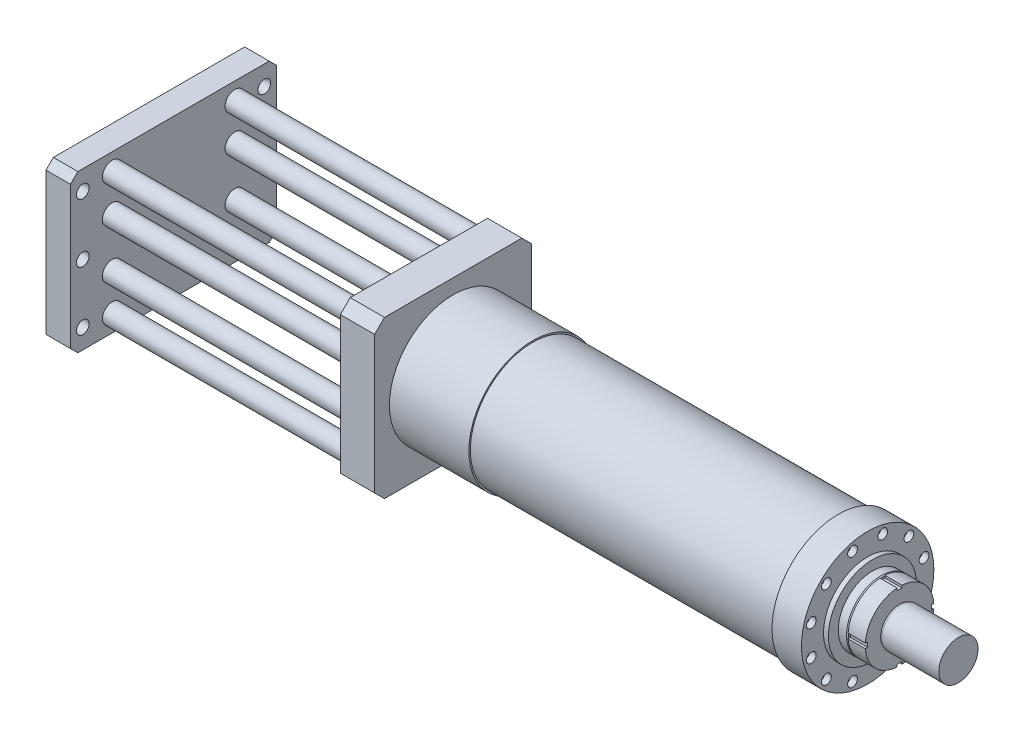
from build123d import *

# Parameters (mm, degrees)
SKETCH_1_R                = 127
SKETCH_1_R_2              = 110
EXTRUDE_1_DEPTH           = 623
SKETCH_2_R                = 135
SKETCH_2_R_2              = 6.5
EXTRUDE_2_DEPTH           = 60
SKETCH_3_R                = 90
EXTRUDE_3_DEPTH           = 10
SKETCH_5_R                = 70
EXTRUDE_4_DEPTH           = 20
CHAMFER_1_SIZE            = 3
CHAMFER_1_SIZE2           = 1.091910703
SKETCH_7_R                = 70
EXTRUDE_5_DEPTH           = 35
SKETCH_8_R                = 38.5
EXTRUDE_6_DEPTH           = 4
SKETCH_9_R                = 40
EXTRUDE_7_DEPTH           = 116
SKETCH_10_W               = 10
SKETCH_10_H               = 12.219318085
SKETCH_10_W_2             = 33.965202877
SKETCH_10_H_2             = 10
SKETCH_10_H_3             = 35.687535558
CUT_EXTRUDE_2_DEPTH       = 35
SKETCH_11_R               = 130
EXTRUDE_8_DEPTH           = 162
SKETCH_15_W               = 320
SKETCH_15_H               = 320
EXTRUDE_10_DEPTH          = 70
SKETCH_16_R               = 80
CUT_EXTRUDE_4_DEPTH       = 26
SKETCH_17_R               = 81.5
CUT_EXTRUDE_5_DEPTH       = 38
EXTRUDE_START             = 500
SKETCH_18_W               = 420
SKETCH_18_H               = 320
SKETCH_18_R               = 13
EXTRUDE_11_DEPTH          = 50
SKETCH_19_R               = 20
EXTRUDE_12_DEPTH          = 500
SKETCH_22_W               = 10
SKETCH_22_H               = 13
HOLE_WIZARD_1_AT_2_COUNT  = 2
HOLE_WIZARD_1_AT_2_PITCH  = 61.598932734
HOLE_WIZARD_1_AT_3_COUNT  = 2
HOLE_WIZARD_1_AT_3_PITCH  = 119
HOLE_WIZARD_1_AT_4_COUNT  = 2
HOLE_WIZARD_1_AT_4_PITCH  = 168.291413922
HOLE_WIZARD_1_AT_5_COUNT  = 2
HOLE_WIZARD_1_AT_5_PITCH  = 206.114046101
HOLE_WIZARD_1_AT_6_COUNT  = 2
HOLE_WIZARD_1_AT_6_PITCH  = 229.890346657
HOLE_WIZARD_1_AT_7_COUNT  = 2
HOLE_WIZARD_1_AT_7_PITCH  = 238
HOLE_WIZARD_1_AT_8_COUNT  = 2
HOLE_WIZARD_1_AT_8_PITCH  = 229.890346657
HOLE_WIZARD_1_AT_9_COUNT  = 2
HOLE_WIZARD_1_AT_9_PITCH  = 206.114046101
HOLE_WIZARD_1_AT_10_COUNT = 2
HOLE_WIZARD_1_AT_10_PITCH = 168.291413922
HOLE_WIZARD_1_AT_11_COUNT = 2
HOLE_WIZARD_1_AT_11_PITCH = 119
HOLE_WIZARD_1_AT_12_COUNT = 2
HOLE_WIZARD_1_AT_12_PITCH = 61.598932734
CHAMFER_2_SIZE            = 20
CHAMFER_3_SIZE            = 15


with BuildPart() as part:
    # Sketch 1 → Extrude 1 (new body)
    with BuildSketch(Plane(origin=(0, 0, 0), x_dir=(0, 0, -1), z_dir=(1, 0, 0))):
        Circle(SKETCH_1_R)
        Circle(SKETCH_1_R_2, mode=Mode.SUBTRACT)
    extrude(amount=EXTRUDE_1_DEPTH)


with BuildPart() as body_2:
    # Sketch 2 → Extrude 2 (new body)
    with BuildSketch(Plane(origin=(623, 0, 0), x_dir=(0, 0, -1), z_dir=(1, 0, 0))):
        Circle(SKETCH_2_R)
        with Locations((30.799466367, 114.945173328)):
            Circle(SKETCH_2_R_2, mode=Mode.SUBTRACT)
        with Locations((84.145706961, 84.145706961)):
            Circle(SKETCH_2_R_2, mode=Mode.SUBTRACT)
        with Locations((114.945173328, 30.799466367)):
            Circle(SKETCH_2_R_2, mode=Mode.SUBTRACT)
        with Locations((114.945173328, -30.799466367)):
            Circle(SKETCH_2_R_2, mode=Mode.SUBTRACT)
        with Locations((84.145706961, -84.145706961)):
            Circle(SKETCH_2_R_2, mode=Mode.SUBTRACT)
        with Locations((30.799466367, -114.945173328)):
            Circle(SKETCH_2_R_2, mode=Mode.SUBTRACT)
        with Locations((-30.799466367, -114.945173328)):
            Circle(SKETCH_2_R_2, mode=Mode.SUBTRACT)
        with Locations((-84.145706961, -84.145706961)):
            Circle(SKETCH_2_R_2, mode=Mode.SUBTRACT)
        with Locations((-114.945173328, -30.799466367)):
            Circle(SKETCH_2_R_2, mode=Mode.SUBTRACT)
        with Locations((-114.945173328, 30.799466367)):
            Circle(SKETCH_2_R_2, mode=Mode.SUBTRACT)
        with Locations((-84.145706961, 84.145706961)):
            Circle(SKETCH_2_R_2, mode=Mode.SUBTRACT)
        with Locations((-30.799466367, 114.945173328)):
            Circle(SKETCH_2_R_2, mode=Mode.SUBTRACT)
    extrude(amount=EXTRUDE_2_DEPTH)

    # Sketch 3 → Extrude 3 (add)
    with BuildSketch(Plane(origin=(683, 0, 0), x_dir=(0, 0, -1), z_dir=(1, 0, 0))):
        Circle(SKETCH_3_R)
    extrude(amount=EXTRUDE_3_DEPTH)

    # Sketch 5 → Extrude 4 (add)
    with BuildSketch(Plane(origin=(693, 0, 0), x_dir=(0, 0, -1), z_dir=(1, 0, 0))):
        Circle(SKETCH_5_R)
    extrude(amount=EXTRUDE_4_DEPTH)

    # Chamfer 1
    chamfer_1_edges = [body_2.edges().sort_by_distance(p)[0] for p in [
        (713, 0, 70),
    ]]
    chamfer_1_side = [body_2.faces().sort_by_distance(p)[0] for p in [
        (703, 0, 70),
    ]]
    chamfer(chamfer_1_edges, length=CHAMFER_1_SIZE, length2=CHAMFER_1_SIZE2, reference=chamfer_1_side[0])

    # Sketch 7 → Extrude 5 (add)
    with BuildSketch(Plane(origin=(713, 0, 0), x_dir=(0, 0, -1), z_dir=(1, 0, 0))):
        Circle(SKETCH_7_R)
    extrude(amount=EXTRUDE_5_DEPTH)

    # Sketch 8 → Extrude 6 (add)
    with BuildSketch(Plane(origin=(748, 0, 0), x_dir=(0, 0, -1), z_dir=(1, 0, 0))):
        Circle(SKETCH_8_R)
    extrude(amount=EXTRUDE_6_DEPTH)

    # Sketch 9 → Extrude 7 (add)
    with BuildSketch(Plane(origin=(752, 0, 0), x_dir=(0, 0, -1), z_dir=(1, 0, 0))):
        with Locations(Location((0, 0, 0), (0, 0, 180))):
            Circle(SKETCH_9_R)
    extrude(amount=EXTRUDE_7_DEPTH)

    # Sketch 10 → Cut-Extrude 2 (cut)
    with BuildSketch(Plane(origin=(748, 0, 0), x_dir=(0, 0, -1), z_dir=(1, 0, 0))):
        with Locations((0, -71.109659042)):
            Rectangle(SKETCH_10_W, SKETCH_10_H)
        Polygon((-76.465931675, 5), (-65, 5), (-65, -5), (-79.460488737, -5), align=None)
        with Locations((81.982601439, 0)):
            Rectangle(SKETCH_10_W_2, SKETCH_10_H_2)
        with Locations((0, 82.843767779)):
            Rectangle(SKETCH_10_W, SKETCH_10_H_3)
    extrude(amount=-CUT_EXTRUDE_2_DEPTH, mode=Mode.SUBTRACT)

    # Sketch 22 → Hole Wizard 1 (revolve, cut)
    with BuildSketch(Plane(origin=(683, 84.145706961, 84.145706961), x_dir=(0, 0, -1), z_dir=(0, 1, 0))):
        with Locations((5, 6.5)):
            Rectangle(SKETCH_22_W, SKETCH_22_H)
    hole_wizard_1 = revolve(axis=Axis((573, 84.145706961, 84.145706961), (1, 0, 0)), mode=Mode.SUBTRACT)

    # Hole Wizard 1 at 2: Hole Wizard 1 ×2
    with Locations(*[Vector(0, 0.5000000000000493, -0.8660254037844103) * (i * HOLE_WIZARD_1_AT_2_PITCH) for i in range(1, HOLE_WIZARD_1_AT_2_COUNT)]):
        add(hole_wizard_1, mode=Mode.SUBTRACT)

    # Hole Wizard 1 at 3: Hole Wizard 1 ×2
    with Locations(*[Vector(0, 0.2588190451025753, -0.9659258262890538) * (i * HOLE_WIZARD_1_AT_3_PITCH) for i in range(1, HOLE_WIZARD_1_AT_3_COUNT)]):
        add(hole_wizard_1, mode=Mode.SUBTRACT)

    # Hole Wizard 1 at 4: Hole Wizard 1 ×2
    with Locations(*[(0, 0, -i * HOLE_WIZARD_1_AT_4_PITCH) for i in range(1, HOLE_WIZARD_1_AT_4_COUNT)]):
        add(hole_wizard_1, mode=Mode.SUBTRACT)

    # Hole Wizard 1 at 5: Hole Wizard 1 ×2
    with Locations(*[Vector(0, -0.2588190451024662, -0.965925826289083) * (i * HOLE_WIZARD_1_AT_5_PITCH) for i in range(1, HOLE_WIZARD_1_AT_5_COUNT)]):
        add(hole_wizard_1, mode=Mode.SUBTRACT)

    # Hole Wizard 1 at 6: Hole Wizard 1 ×2
    with Locations(*[Vector(0, -0.49999999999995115, -0.8660254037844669) * (i * HOLE_WIZARD_1_AT_6_PITCH) for i in range(1, HOLE_WIZARD_1_AT_6_COUNT)]):
        add(hole_wizard_1, mode=Mode.SUBTRACT)

    # Hole Wizard 1 at 7: Hole Wizard 1 ×2
    with Locations(*[Vector(0, -0.7071067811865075, -0.7071067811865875) * (i * HOLE_WIZARD_1_AT_7_PITCH) for i in range(1, HOLE_WIZARD_1_AT_7_COUNT)]):
        add(hole_wizard_1, mode=Mode.SUBTRACT)

    # Hole Wizard 1 at 8: Hole Wizard 1 ×2
    with Locations(*[Vector(0, -0.8660254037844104, -0.5000000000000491) * (i * HOLE_WIZARD_1_AT_8_PITCH) for i in range(1, HOLE_WIZARD_1_AT_8_COUNT)]):
        add(hole_wizard_1, mode=Mode.SUBTRACT)

    # Hole Wizard 1 at 9: Hole Wizard 1 ×2
    with Locations(*[Vector(0, -0.9659258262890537, -0.2588190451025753) * (i * HOLE_WIZARD_1_AT_9_PITCH) for i in range(1, HOLE_WIZARD_1_AT_9_COUNT)]):
        add(hole_wizard_1, mode=Mode.SUBTRACT)

    # Hole Wizard 1 at 10: Hole Wizard 1 ×2
    with Locations(*[(0, -i * HOLE_WIZARD_1_AT_10_PITCH, 0) for i in range(1, HOLE_WIZARD_1_AT_10_COUNT)]):
        add(hole_wizard_1, mode=Mode.SUBTRACT)

    # Hole Wizard 1 at 11: Hole Wizard 1 ×2
    with Locations(*[Vector(0, -0.9659258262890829, 0.2588190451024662) * (i * HOLE_WIZARD_1_AT_11_PITCH) for i in range(1, HOLE_WIZARD_1_AT_11_COUNT)]):
        add(hole_wizard_1, mode=Mode.SUBTRACT)

    # Hole Wizard 1 at 12: Hole Wizard 1 ×2
    with Locations(*[Vector(0, -0.8660254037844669, 0.4999999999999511) * (i * HOLE_WIZARD_1_AT_12_PITCH) for i in range(1, HOLE_WIZARD_1_AT_12_COUNT)]):
        add(hole_wizard_1, mode=Mode.SUBTRACT)


with BuildPart() as body_3:
    # Sketch 11 → Extrude 8 (new body)
    with BuildSketch(Plane.ZY):
        Circle(SKETCH_11_R)
    extrude(amount=EXTRUDE_8_DEPTH)


with BuildPart() as body_4:
    # Sketch 15 → Extrude 10 (new body)
    with BuildSketch(Plane.ZY.offset(162)):
        Rectangle(SKETCH_15_W, SKETCH_15_H)
    extrude(amount=EXTRUDE_10_DEPTH)

    # Sketch 16 → Cut-Extrude 4 (cut)
    with BuildSketch(Plane.ZY.offset(232)):
        Circle(SKETCH_16_R)
    extrude(amount=-CUT_EXTRUDE_4_DEPTH, mode=Mode.SUBTRACT)

    # Sketch 17 → Cut-Extrude 5 (cut)
    with BuildSketch(Plane.ZY.offset(206)):
        Circle(SKETCH_17_R)
    extrude(amount=-CUT_EXTRUDE_5_DEPTH, mode=Mode.SUBTRACT)

    # Sketch 19 → Extrude 12 (add)
    with BuildSketch(Plane.ZY.offset(232)):
        with Locations((125, 125)):
            Circle(SKETCH_19_R)
        with Locations((125, -125)):
            Circle(SKETCH_19_R)
        with Locations(Location((-125, -125, 0), (0, 0, 180))):
            Circle(SKETCH_19_R)
        with Locations(Location((-125, 125, 0), (0, 0, 180))):
            Circle(SKETCH_19_R)
        with Locations((-125, 50)):
            Circle(SKETCH_19_R)
        with Locations((-125, -50)):
            Circle(SKETCH_19_R)
        with Locations((125, 50)):
            Circle(SKETCH_19_R)
        with Locations((125, -50)):
            Circle(SKETCH_19_R)
    extrude(amount=EXTRUDE_12_DEPTH)

    # Chamfer 2
    chamfer_2_edges = [body_4.edges().sort_by_distance(p)[0] for p in [
        (-197, -160, 160),
        (-197, -160, -160),
        (-197, 160, -160),
        (-197, 160, 160),
    ]]
    chamfer(chamfer_2_edges, length=CHAMFER_2_SIZE)


with BuildPart() as body_5:
    # Sketch 18 → Extrude 11 (new body)
    with BuildSketch(Plane.ZY.offset(232).offset(EXTRUDE_START)):
        Rectangle(SKETCH_18_W, SKETCH_18_H)
        with Locations((-185, 120)):
            Circle(SKETCH_18_R, mode=Mode.SUBTRACT)
        with Locations((-185, 0)):
            Circle(SKETCH_18_R, mode=Mode.SUBTRACT)
        with Locations((-185, -120)):
            Circle(SKETCH_18_R, mode=Mode.SUBTRACT)
        with Locations(Location((185, -120, 0), (0, 0, 180))):
            Circle(SKETCH_18_R, mode=Mode.SUBTRACT)
        with Locations(Location((185, 0, 0), (0, 0, 180))):
            Circle(SKETCH_18_R, mode=Mode.SUBTRACT)
        with Locations(Location((185, 120, 0), (0, 0, 180))):
            Circle(SKETCH_18_R, mode=Mode.SUBTRACT)
    extrude(amount=EXTRUDE_11_DEPTH)

    # Chamfer 3
    chamfer_3_edges = [body_5.edges().sort_by_distance(p)[0] for p in [
        (-757, -160, 210),
        (-757, -160, -210),
        (-757, 160, -210),
        (-757, 160, 210),
    ]]
    chamfer(chamfer_3_edges, length=CHAMFER_3_SIZE)


solid = Compound([part.part, body_2.part, body_3.part, body_4.part, body_5.part])
